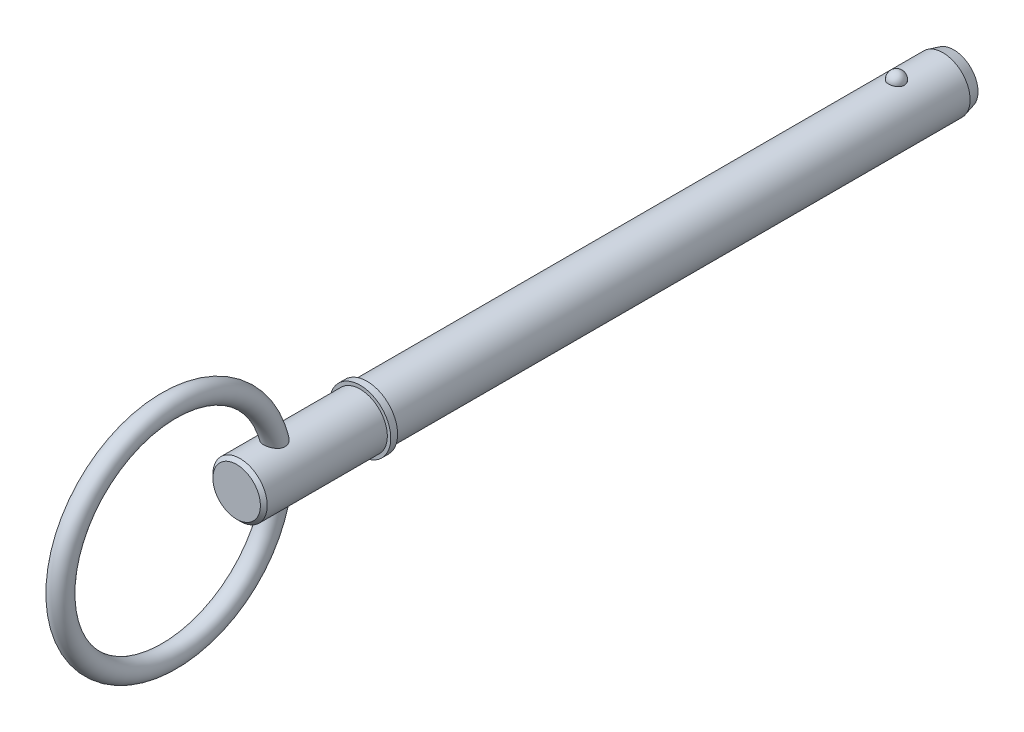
ISO-10303-21;
HEADER;
FILE_DESCRIPTION(('STEP AP214'),'2;1');
FILE_NAME('part.step','',(''),(''),'','','');
FILE_SCHEMA(('AUTOMOTIVE_DESIGN { 1 0 10303 214 1 1 1 1 }'));
ENDSEC;
DATA;
#1=APPLICATION_CONTEXT('core data for automotive mechanical design processes');
#2=APPLICATION_PROTOCOL_DEFINITION('international standard','automotive_design',2000,#1);
#3=PRODUCT_CONTEXT('',#1,'mechanical');
#4=PRODUCT('Part','Part','',(#3));
#5=PRODUCT_RELATED_PRODUCT_CATEGORY('part','',(#4));
#6=PRODUCT_DEFINITION_FORMATION('','',#4);
#7=PRODUCT_DEFINITION_CONTEXT('part definition',#1,'design');
#8=PRODUCT_DEFINITION('design','',#6,#7);
#9=PRODUCT_DEFINITION_SHAPE('','',#8);
#10=(LENGTH_UNIT() NAMED_UNIT(*) SI_UNIT(.MILLI.,.METRE.));
#11=(NAMED_UNIT(*) PLANE_ANGLE_UNIT() SI_UNIT($,.RADIAN.));
#12=(NAMED_UNIT(*) SI_UNIT($,.STERADIAN.) SOLID_ANGLE_UNIT());
#13=UNCERTAINTY_MEASURE_WITH_UNIT(LENGTH_MEASURE(1.E-05),#10,'distance_accuracy_value','');
#14=(GEOMETRIC_REPRESENTATION_CONTEXT(3) GLOBAL_UNCERTAINTY_ASSIGNED_CONTEXT((#13)) GLOBAL_UNIT_ASSIGNED_CONTEXT((#10,
#11,#12)) REPRESENTATION_CONTEXT('',''));
#15=CARTESIAN_POINT('',(0.,0.,0.));
#16=DIRECTION('',(0.,0.,1.));
#17=DIRECTION('',(1.,0.,0.));
#18=AXIS2_PLACEMENT_3D('',#15,#16,#17);
#19=CARTESIAN_POINT('',(0.,0.,76.2));
#20=DIRECTION('',(0.,0.,-1.));
#21=DIRECTION('',(-1.,0.,0.));
#22=AXIS2_PLACEMENT_3D('',#19,#20,#21);
#23=CYLINDRICAL_SURFACE('',#22,3.97);
#24=CARTESIAN_POINT('',(1.13787398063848,3.80343828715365,-1.15));
#25=CARTESIAN_POINT('',(1.13787307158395,3.80343910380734,-1.0857397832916));
#26=CARTESIAN_POINT('',(1.13264657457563,3.80501406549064,-1.02146820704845));
#27=CARTESIAN_POINT('',(1.11186534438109,3.81113760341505,-0.894749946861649));
#28=CARTESIAN_POINT('',(1.09630734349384,3.81568712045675,-0.832303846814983));
#29=CARTESIAN_POINT('',(1.05525533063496,3.82724281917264,-0.711040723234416));
#30=CARTESIAN_POINT('',(1.02976565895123,3.83424792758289,-0.65222212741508));
#31=CARTESIAN_POINT('',(0.969477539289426,3.84993235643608,-0.539814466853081));
#32=CARTESIAN_POINT('',(0.934679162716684,3.85861166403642,-0.48622536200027));
#33=CARTESIAN_POINT('',(0.856427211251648,3.87673176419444,-0.385470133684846));
#34=CARTESIAN_POINT('',(0.812928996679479,3.88617632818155,-0.338339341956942));
#35=CARTESIAN_POINT('',(0.718506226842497,3.90473543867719,-0.252134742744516));
#36=CARTESIAN_POINT('',(0.667581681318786,3.91384998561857,-0.213060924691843));
#37=CARTESIAN_POINT('',(0.559829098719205,3.93070626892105,-0.144169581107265));
#38=CARTESIAN_POINT('',(0.503019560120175,3.93845211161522,-0.114324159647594));
#39=CARTESIAN_POINT('',(0.384957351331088,3.95173781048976,-0.0645874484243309));
#40=CARTESIAN_POINT('',(0.323705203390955,3.95727792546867,-0.044694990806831));
#41=CARTESIAN_POINT('',(0.1997490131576,3.96544869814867,-0.015729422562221));
#42=CARTESIAN_POINT('',(0.137095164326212,3.96813298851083,-0.00645660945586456));
#43=CARTESIAN_POINT('',(0.0110617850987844,3.97048461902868,0.00167939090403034));
#44=CARTESIAN_POINT('',(-0.0523176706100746,3.97015226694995,0.000543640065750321));
#45=CARTESIAN_POINT('',(-0.176983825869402,3.96653606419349,-0.0120046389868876));
#46=CARTESIAN_POINT('',(-0.238287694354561,3.96329719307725,-0.0232605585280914));
#47=CARTESIAN_POINT('',(-0.358077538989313,3.95427494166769,-0.0555133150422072));
#48=CARTESIAN_POINT('',(-0.416563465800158,3.94849151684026,-0.0765103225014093));
#49=CARTESIAN_POINT('',(-0.529474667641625,3.9349475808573,-0.127824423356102));
#50=CARTESIAN_POINT('',(-0.583873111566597,3.92717527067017,-0.158197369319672));
#51=CARTESIAN_POINT('',(-0.686796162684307,3.9104901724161,-0.227402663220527));
#52=CARTESIAN_POINT('',(-0.735320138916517,3.90157726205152,-0.266235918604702));
#53=CARTESIAN_POINT('',(-0.826197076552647,3.88336108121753,-0.352210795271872));
#54=CARTESIAN_POINT('',(-0.868404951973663,3.87405356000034,-0.39950492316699));
#55=CARTESIAN_POINT('',(-0.944393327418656,3.85623507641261,-0.500572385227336));
#56=CARTESIAN_POINT('',(-0.978173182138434,3.84772417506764,-0.554346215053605));
#57=CARTESIAN_POINT('',(-1.036841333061,3.83233550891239,-0.667624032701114));
#58=CARTESIAN_POINT('',(-1.06161430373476,3.82547928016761,-0.727190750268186));
#59=CARTESIAN_POINT('',(-1.1010562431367,3.81431496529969,-0.849806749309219));
#60=CARTESIAN_POINT('',(-1.11572551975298,3.81000680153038,-0.912855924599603));
#61=CARTESIAN_POINT('',(-1.13455293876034,3.80444307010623,-1.0403529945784));
#62=CARTESIAN_POINT('',(-1.13875701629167,3.80317416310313,-1.10479351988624));
#63=CARTESIAN_POINT('',(-1.13668244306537,3.80379469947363,-1.23348881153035));
#64=CARTESIAN_POINT('',(-1.13040410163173,3.80568404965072,-1.29774358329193));
#65=CARTESIAN_POINT('',(-1.10758455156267,3.81238701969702,-1.42388263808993));
#66=CARTESIAN_POINT('',(-1.09109911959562,3.81718474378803,-1.48577787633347));
#67=CARTESIAN_POINT('',(-1.04831897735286,3.82915360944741,-1.6058363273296));
#68=CARTESIAN_POINT('',(-1.02202385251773,3.83632485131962,-1.66399938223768));
#69=CARTESIAN_POINT('',(-0.960087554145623,3.85229234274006,-1.77531672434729));
#70=CARTESIAN_POINT('',(-0.924393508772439,3.86109769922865,-1.82844028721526));
#71=CARTESIAN_POINT('',(-0.844617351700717,3.87932868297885,-1.92784641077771));
#72=CARTESIAN_POINT('',(-0.800534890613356,3.88875433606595,-1.97412868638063));
#73=CARTESIAN_POINT('',(-0.704909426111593,3.90722138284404,-2.05875748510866));
#74=CARTESIAN_POINT('',(-0.653336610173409,3.91626104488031,-2.09707073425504));
#75=CARTESIAN_POINT('',(-0.544251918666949,3.93290335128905,-2.16444159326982));
#76=CARTESIAN_POINT('',(-0.486740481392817,3.94050610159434,-2.19349988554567));
#77=CARTESIAN_POINT('',(-0.368186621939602,3.95333328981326,-2.24120607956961));
#78=CARTESIAN_POINT('',(-0.307200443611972,3.9585876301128,-2.25998559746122));
#79=CARTESIAN_POINT('',(-0.182787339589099,3.96627905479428,-2.28716436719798));
#80=CARTESIAN_POINT('',(-0.119360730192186,3.96871650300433,-2.29556495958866));
#81=CARTESIAN_POINT('',(0.0067634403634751,3.97048518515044,-2.30167748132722));
#82=CARTESIAN_POINT('',(0.0694499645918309,3.96987797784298,-2.299601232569));
#83=CARTESIAN_POINT('',(0.19355548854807,3.96576491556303,-2.28530777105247));
#84=CARTESIAN_POINT('',(0.254974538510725,3.96225917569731,-2.27309096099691));
#85=CARTESIAN_POINT('',(0.374550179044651,3.95274547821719,-2.2389384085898));
#86=CARTESIAN_POINT('',(0.43271967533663,3.94674835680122,-2.2170447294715));
#87=CARTESIAN_POINT('',(0.544514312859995,3.93288448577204,-2.16414952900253));
#88=CARTESIAN_POINT('',(0.598139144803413,3.92501760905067,-2.13314738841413));
#89=CARTESIAN_POINT('',(0.700284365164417,3.90809781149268,-2.06228741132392));
#90=CARTESIAN_POINT('',(0.748708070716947,3.89902775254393,-2.02229434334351));
#91=CARTESIAN_POINT('',(0.838215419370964,3.88077133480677,-1.93481443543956));
#92=CARTESIAN_POINT('',(0.87929781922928,3.87158495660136,-1.88732632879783));
#93=CARTESIAN_POINT('',(0.953804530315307,3.85391414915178,-1.78516284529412));
#94=CARTESIAN_POINT('',(0.98707138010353,3.8454460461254,-1.73036973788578));
#95=CARTESIAN_POINT('',(1.04410491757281,3.83035507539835,-1.61582422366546));
#96=CARTESIAN_POINT('',(1.06787445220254,3.82373165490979,-1.5560733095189));
#97=CARTESIAN_POINT('',(1.10358064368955,3.813570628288,-1.43904746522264));
#98=CARTESIAN_POINT('',(1.11641754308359,3.80980198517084,-1.38206535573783));
#99=CARTESIAN_POINT('',(1.13356451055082,3.80473547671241,-1.26672526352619));
#100=CARTESIAN_POINT('',(1.13787480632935,3.80343754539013,-1.20836731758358));
#101=CARTESIAN_POINT('',(1.13787398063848,3.80343828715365,-1.15));
#102=B_SPLINE_CURVE_WITH_KNOTS('',3,(#24,#25,#26,#27,#28,#29,#30,#31,#32,#33,#34,#35,#36,#37,
#38,#39,#40,#41,#42,#43,#44,#45,#46,#47,#48,#49,#50,#51,#52,#53,#54,#55,#56,#57,#58,#59,#60,#61,
#62,#63,#64,#65,#66,#67,#68,#69,#70,#71,#72,#73,#74,#75,#76,#77,#78,#79,#80,#81,#82,#83,#84,#85,
#86,#87,#88,#89,#90,#91,#92,#93,#94,#95,#96,#97,#98,#99,#100,#101),.UNSPECIFIED.,.T.,.F.,(4,2,2,
2,2,2,2,2,2,2,2,2,2,2,2,2,2,2,2,2,2,2,2,2,2,2,2,2,2,2,2,2,2,2,2,2,2,2,4),(0.,0.192571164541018,
0.385203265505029,0.577751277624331,0.770297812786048,0.963858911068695,1.15741975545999,
1.35038964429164,1.54333688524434,1.73259288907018,1.92182958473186,2.10818732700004,
2.2945483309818,2.48204164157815,2.66955507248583,2.86087083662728,3.05220124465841,
3.24590171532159,3.43959628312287,3.63243915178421,3.82527632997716,4.01706893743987,
4.20886965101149,4.40177324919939,4.59468488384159,4.78838651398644,4.9820738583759,
5.17321934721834,5.36434014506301,5.55161251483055,5.7388774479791,5.92533626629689,
6.11180776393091,6.30129785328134,6.49082000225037,6.68388392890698,6.87688993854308,
7.05180628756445,7.22671796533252),.UNSPECIFIED.);
#103=CARTESIAN_POINT('',(1.13787398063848,3.80343828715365,-1.15));
#104=VERTEX_POINT('',#103);
#105=EDGE_CURVE('E102',#104,#104,#102,.T.);
#106=ORIENTED_EDGE('',*,*,#105,.T.);
#107=EDGE_LOOP('',(#106));
#108=FACE_BOUND('',#107,.T.);
#109=CARTESIAN_POINT('',(0.,0.,-7.94400000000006));
#110=DIRECTION('',(0.,0.,-1.));
#111=DIRECTION('',(-1.,0.,0.));
#112=AXIS2_PLACEMENT_3D('',#109,#110,#111);
#113=CIRCLE('',#112,3.97);
#114=CARTESIAN_POINT('',(-3.97,0.,-7.94400000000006));
#115=VERTEX_POINT('',#114);
#116=EDGE_CURVE('E110',#115,#115,#113,.F.);
#117=ORIENTED_EDGE('',*,*,#116,.T.);
#118=EDGE_LOOP('',(#117));
#119=FACE_BOUND('',#118,.T.);
#120=CARTESIAN_POINT('',(0.,0.,76.2));
#121=DIRECTION('',(0.,0.,1.));
#122=DIRECTION('',(1.,0.,0.));
#123=AXIS2_PLACEMENT_3D('',#120,#121,#122);
#124=CIRCLE('',#123,3.97);
#125=CARTESIAN_POINT('',(3.97,0.,76.2));
#126=VERTEX_POINT('',#125);
#127=EDGE_CURVE('E108',#126,#126,#124,.T.);
#128=ORIENTED_EDGE('',*,*,#127,.F.);
#129=EDGE_LOOP('',(#128));
#130=FACE_BOUND('',#129,.T.);
#131=ADVANCED_FACE('F39',(#108,#119,#130),#23,.T.);
#132=CARTESIAN_POINT('',(0.,0.,-9.53));
#133=DIRECTION('',(0.,0.,-1.));
#134=DIRECTION('',(-1.,0.,0.));
#135=AXIS2_PLACEMENT_3D('',#132,#133,#134);
#136=PLANE('',#135);
#137=CARTESIAN_POINT('',(0.,0.,-9.53));
#138=DIRECTION('',(0.,0.,-1.));
#139=DIRECTION('',(-1.,0.,0.));
#140=AXIS2_PLACEMENT_3D('',#137,#138,#139);
#141=CIRCLE('',#140,3.54503258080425);
#142=CARTESIAN_POINT('',(-3.54503258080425,0.,-9.53));
#143=VERTEX_POINT('',#142);
#144=EDGE_CURVE('E142',#143,#143,#141,.T.);
#145=ORIENTED_EDGE('',*,*,#144,.T.);
#146=EDGE_LOOP('',(#145));
#147=FACE_BOUND('',#146,.T.);
#148=ADVANCED_FACE('F88',(#147),#136,.T.);
#149=CARTESIAN_POINT('',(0.,0.,-9.53));
#150=DIRECTION('',(0.,0.,1.));
#151=DIRECTION('',(1.,0.,0.));
#152=AXIS2_PLACEMENT_3D('',#149,#150,#151);
#153=CONICAL_SURFACE('',#152,3.54503258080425,0.261799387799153);
#154=ORIENTED_EDGE('',*,*,#116,.F.);
#155=EDGE_LOOP('',(#154));
#156=FACE_BOUND('',#155,.T.);
#157=ORIENTED_EDGE('',*,*,#144,.F.);
#158=EDGE_LOOP('',(#157));
#159=FACE_BOUND('',#158,.T.);
#160=ADVANCED_FACE('F94',(#156,#159),#153,.T.);
#161=CARTESIAN_POINT('',(0.,3.97,-1.15));
#162=DIRECTION('',(0.,1.,0.));
#163=DIRECTION('',(0.,0.,-1.));
#164=AXIS2_PLACEMENT_3D('',#161,#162,#163);
#165=SPHERICAL_SURFACE('',#164,1.15);
#166=ORIENTED_EDGE('',*,*,#105,.F.);
#167=EDGE_LOOP('',(#166));
#168=FACE_BOUND('',#167,.T.);
#169=ADVANCED_FACE('F113',(#168),#165,.T.);
#170=CARTESIAN_POINT('',(0.,0.,76.2));
#171=DIRECTION('',(0.,0.,-1.));
#172=DIRECTION('',(-1.,0.,0.));
#173=AXIS2_PLACEMENT_3D('',#170,#171,#172);
#174=PLANE('',#173);
#175=ORIENTED_EDGE('',*,*,#127,.T.);
#176=EDGE_LOOP('',(#175));
#177=FACE_BOUND('',#176,.T.);
#178=CARTESIAN_POINT('',(0.,0.,76.2));
#179=DIRECTION('',(0.,0.,-1.));
#180=DIRECTION('',(-1.,0.,0.));
#181=AXIS2_PLACEMENT_3D('',#178,#179,#180);
#182=CIRCLE('',#181,4.47);
#183=CARTESIAN_POINT('',(-4.47,0.,76.2));
#184=VERTEX_POINT('',#183);
#185=EDGE_CURVE('E109',#184,#184,#182,.T.);
#186=ORIENTED_EDGE('',*,*,#185,.T.);
#187=EDGE_LOOP('',(#186));
#188=FACE_BOUND('',#187,.T.);
#189=ADVANCED_FACE('F117',(#177,#188),#174,.T.);
#190=CARTESIAN_POINT('',(0.,0.,33.7287874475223));
#191=DIRECTION('',(0.,0.,-1.));
#192=DIRECTION('',(-1.,0.,0.));
#193=AXIS2_PLACEMENT_3D('',#190,#191,#192);
#194=CYLINDRICAL_SURFACE('',#193,4.47);
#195=CARTESIAN_POINT('',(0.,0.,77.2));
#196=DIRECTION('',(0.,0.,-1.));
#197=DIRECTION('',(-1.,0.,0.));
#198=AXIS2_PLACEMENT_3D('',#195,#196,#197);
#199=CIRCLE('',#198,4.47);
#200=CARTESIAN_POINT('',(-4.47,0.,77.2));
#201=VERTEX_POINT('',#200);
#202=EDGE_CURVE('E134',#201,#201,#199,.T.);
#203=ORIENTED_EDGE('',*,*,#202,.T.);
#204=EDGE_LOOP('',(#203));
#205=FACE_BOUND('',#204,.T.);
#206=ORIENTED_EDGE('',*,*,#185,.F.);
#207=EDGE_LOOP('',(#206));
#208=FACE_BOUND('',#207,.T.);
#209=ADVANCED_FACE('F121',(#205,#208),#194,.T.);
#210=CARTESIAN_POINT('',(0.,4.47,77.2));
#211=DIRECTION('',(0.,0.,1.));
#212=DIRECTION('',(1.,0.,0.));
#213=AXIS2_PLACEMENT_3D('',#210,#211,#212);
#214=PLANE('',#213);
#215=CARTESIAN_POINT('',(0.,0.,77.2));
#216=DIRECTION('',(0.,0.,1.));
#217=DIRECTION('',(1.,0.,0.));
#218=AXIS2_PLACEMENT_3D('',#215,#216,#217);
#219=CIRCLE('',#218,3.97);
#220=CARTESIAN_POINT('',(3.97,0.,77.2));
#221=VERTEX_POINT('',#220);
#222=EDGE_CURVE('E112',#221,#221,#219,.T.);
#223=ORIENTED_EDGE('',*,*,#222,.F.);
#224=EDGE_LOOP('',(#223));
#225=FACE_BOUND('',#224,.T.);
#226=ORIENTED_EDGE('',*,*,#202,.F.);
#227=EDGE_LOOP('',(#226));
#228=FACE_BOUND('',#227,.T.);
#229=ADVANCED_FACE('F85',(#225,#228),#214,.T.);
#230=CARTESIAN_POINT('',(0.,0.,95.25));
#231=DIRECTION('',(0.,0.,-1.));
#232=DIRECTION('',(-1.,0.,0.));
#233=AXIS2_PLACEMENT_3D('',#230,#231,#232);
#234=CYLINDRICAL_SURFACE('',#233,3.97);
#235=CARTESIAN_POINT('',(-0.740636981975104,-3.90030215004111,88.3942081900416));
#236=CARTESIAN_POINT('',(-0.667733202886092,-3.91414543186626,88.354930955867));
#237=CARTESIAN_POINT('',(-0.591347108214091,-3.92651643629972,88.3215983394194));
#238=CARTESIAN_POINT('',(-0.43370932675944,-3.94703799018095,88.2675410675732));
#239=CARTESIAN_POINT('',(-0.352458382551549,-3.95518918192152,88.2468144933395));
#240=CARTESIAN_POINT('',(-0.187320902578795,-3.96644185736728,88.2184263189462));
#241=CARTESIAN_POINT('',(-0.103433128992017,-3.9695409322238,88.2107709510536));
#242=CARTESIAN_POINT('',(0.064529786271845,-3.97036376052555,88.2087268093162));
#243=CARTESIAN_POINT('',(0.148604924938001,-3.96808759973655,88.2143378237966));
#244=CARTESIAN_POINT('',(0.313967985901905,-3.95842655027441,88.2386101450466));
#245=CARTESIAN_POINT('',(0.395270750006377,-3.95107581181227,88.2571842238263));
#246=CARTESIAN_POINT('',(0.553418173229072,-3.93204472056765,88.3068699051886));
#247=CARTESIAN_POINT('',(0.630262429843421,-3.92036397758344,88.3379826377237));
#248=CARTESIAN_POINT('',(0.777983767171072,-3.89375421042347,88.4123739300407));
#249=CARTESIAN_POINT('',(0.848809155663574,-3.8788003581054,88.4557462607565));
#250=CARTESIAN_POINT('',(0.981880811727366,-3.84727071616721,88.5536515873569));
#251=CARTESIAN_POINT('',(1.04412630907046,-3.83069478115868,88.6081855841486));
#252=CARTESIAN_POINT('',(1.15846819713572,-3.79768496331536,88.7274397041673));
#253=CARTESIAN_POINT('',(1.21053047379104,-3.78125172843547,88.7921927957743));
#254=CARTESIAN_POINT('',(1.30266807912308,-3.75050988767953,88.9301698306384));
#255=CARTESIAN_POINT('',(1.34274789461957,-3.73620048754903,89.0033905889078));
#256=CARTESIAN_POINT('',(1.40857853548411,-3.71187334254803,89.1536278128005));
#257=CARTESIAN_POINT('',(1.43477198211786,-3.70172571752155,89.2304292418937));
#258=CARTESIAN_POINT('',(1.47426417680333,-3.68617713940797,89.3877211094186));
#259=CARTESIAN_POINT('',(1.48756557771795,-3.68077520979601,89.468210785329));
#260=CARTESIAN_POINT('',(1.5011302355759,-3.67526295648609,89.6282774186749));
#261=CARTESIAN_POINT('',(1.50172918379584,-3.67501639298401,89.7078221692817));
#262=CARTESIAN_POINT('',(1.4912869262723,-3.67926498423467,89.8660010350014));
#263=CARTESIAN_POINT('',(1.48024221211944,-3.68376156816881,89.9446348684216));
#264=CARTESIAN_POINT('',(1.44631002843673,-3.69722026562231,90.1039961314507));
#265=CARTESIAN_POINT('',(1.42273446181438,-3.7064405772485,90.1845537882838));
#266=CARTESIAN_POINT('',(1.36440745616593,-3.72830487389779,90.3410229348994));
#267=CARTESIAN_POINT('',(1.32965006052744,-3.74095068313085,90.4169319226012));
#268=CARTESIAN_POINT('',(1.244983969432,-3.77003365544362,90.5715893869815));
#269=CARTESIAN_POINT('',(1.19374759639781,-3.78674477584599,90.6495625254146));
#270=CARTESIAN_POINT('',(1.07927226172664,-3.82094743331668,90.796060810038));
#271=CARTESIAN_POINT('',(1.0160234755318,-3.83843960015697,90.8645781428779));
#272=CARTESIAN_POINT('',(0.875824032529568,-3.87288453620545,90.9922425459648));
#273=CARTESIAN_POINT('',(0.798445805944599,-3.88979192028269,91.0509375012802));
#274=CARTESIAN_POINT('',(0.633271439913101,-3.92005992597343,91.1524486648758));
#275=CARTESIAN_POINT('',(0.545492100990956,-3.9334261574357,91.1952900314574));
#276=CARTESIAN_POINT('',(0.374503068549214,-3.9531041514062,91.2573026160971));
#277=CARTESIAN_POINT('',(0.292250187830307,-3.96011991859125,91.2788718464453));
#278=CARTESIAN_POINT('',(0.124887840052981,-3.96891507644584,91.3058171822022));
#279=CARTESIAN_POINT('',(0.0397822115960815,-3.97070123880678,91.311214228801));
#280=CARTESIAN_POINT('',(-0.116598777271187,-3.96893737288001,91.3058414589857));
#281=CARTESIAN_POINT('',(-0.187977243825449,-3.96616998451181,91.2974431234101));
#282=CARTESIAN_POINT('',(-0.32822445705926,-3.95703238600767,91.2693459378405));
#283=CARTESIAN_POINT('',(-0.397092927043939,-3.95066177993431,91.2496458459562));
#284=CARTESIAN_POINT('',(-0.53077782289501,-3.93493622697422,91.2000024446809));
#285=CARTESIAN_POINT('',(-0.595585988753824,-3.92557541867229,91.1700390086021));
#286=CARTESIAN_POINT('',(-0.719890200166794,-3.904694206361,91.1012213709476));
#287=CARTESIAN_POINT('',(-0.779384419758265,-3.89317306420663,91.0623641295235));
#288=CARTESIAN_POINT('',(-0.900171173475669,-3.86715924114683,90.9711356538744));
#289=CARTESIAN_POINT('',(-0.960570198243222,-3.85247602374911,90.9176378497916));
#290=CARTESIAN_POINT('',(-1.07286582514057,-3.82272677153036,90.8024377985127));
#291=CARTESIAN_POINT('',(-1.12475588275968,-3.8076604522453,90.7407293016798));
#292=CARTESIAN_POINT('',(-1.22682603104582,-3.7761197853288,90.6003072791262));
#293=CARTESIAN_POINT('',(-1.27547686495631,-3.75979238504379,90.5204426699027));
#294=CARTESIAN_POINT('',(-1.35956460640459,-3.73021138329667,90.3534537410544));
#295=CARTESIAN_POINT('',(-1.39499536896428,-3.71695921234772,90.2663260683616));
#296=CARTESIAN_POINT('',(-1.45224550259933,-3.6949785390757,90.0837644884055));
#297=CARTESIAN_POINT('',(-1.47355906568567,-3.68641985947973,89.9881485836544));
#298=CARTESIAN_POINT('',(-1.49891316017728,-3.67618897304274,89.7943060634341));
#299=CARTESIAN_POINT('',(-1.50297414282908,-3.67450861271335,89.6960826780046));
#300=CARTESIAN_POINT('',(-1.49322338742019,-3.67847743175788,89.5115204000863));
#301=CARTESIAN_POINT('',(-1.48132891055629,-3.68334053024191,89.425062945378));
#302=CARTESIAN_POINT('',(-1.44277978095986,-3.69860964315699,89.2560202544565));
#303=CARTESIAN_POINT('',(-1.41613105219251,-3.70901343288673,89.1734334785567));
#304=CARTESIAN_POINT('',(-1.35164005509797,-3.73296583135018,89.0217432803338));
#305=CARTESIAN_POINT('',(-1.31494998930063,-3.7461693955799,88.9520907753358));
#306=CARTESIAN_POINT('',(-1.23078033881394,-3.77465882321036,88.8201142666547));
#307=CARTESIAN_POINT('',(-1.18329862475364,-3.7899450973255,88.7577917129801));
#308=CARTESIAN_POINT('',(-1.07555346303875,-3.82196646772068,88.638244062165));
#309=CARTESIAN_POINT('',(-1.01467770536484,-3.83873247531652,88.5815789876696));
#310=CARTESIAN_POINT('',(-0.883925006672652,-3.87093079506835,88.479334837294));
#311=CARTESIAN_POINT('',(-0.814046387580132,-3.88636285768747,88.4337578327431));
#312=CARTESIAN_POINT('',(-0.740636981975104,-3.90030215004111,88.3942081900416));
#313=B_SPLINE_CURVE_WITH_KNOTS('',3,(#235,#236,#237,#238,#239,#240,#241,#242,#243,#244,#245,
#246,#247,#248,#249,#250,#251,#252,#253,#254,#255,#256,#257,#258,#259,#260,#261,#262,#263,#264,
#265,#266,#267,#268,#269,#270,#271,#272,#273,#274,#275,#276,#277,#278,#279,#280,#281,#282,#283,
#284,#285,#286,#287,#288,#289,#290,#291,#292,#293,#294,#295,#296,#297,#298,#299,#300,#301,#302,
#303,#304,#305,#306,#307,#308,#309,#310,#311,#312),.UNSPECIFIED.,.T.,.F.,(4,2,2,2,2,2,2,2,2,2,2,
2,2,2,2,2,2,2,2,2,2,2,2,2,2,2,2,2,2,2,2,2,2,2,2,2,2,2,4),(0.,0.251585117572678,
0.503131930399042,0.754798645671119,1.00646134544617,1.25644674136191,1.50645467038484,
1.75842915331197,2.01042624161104,2.26325358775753,2.51598614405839,2.76008726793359,
3.00413815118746,3.24173115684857,3.47939577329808,3.7317117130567,3.9841622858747,
4.26728153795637,4.55063334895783,4.84469622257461,5.13829042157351,5.39265192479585,
5.64668391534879,5.86142364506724,6.07618697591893,6.29137389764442,6.50663447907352,
6.75172833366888,6.99700982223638,7.28055118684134,7.56422418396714,7.85757857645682,
8.15058512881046,8.41135406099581,8.67201836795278,8.91039015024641,9.14880900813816,
9.40209172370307,9.65542171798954),.UNSPECIFIED.);
#314=CARTESIAN_POINT('',(-0.740636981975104,-3.90030215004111,88.3942081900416));
#315=VERTEX_POINT('',#314);
#316=EDGE_CURVE('E10',#315,#315,#313,.T.);
#317=ORIENTED_EDGE('',*,*,#316,.F.);
#318=EDGE_LOOP('',(#317));
#319=FACE_BOUND('',#318,.T.);
#320=CARTESIAN_POINT('',(-0.740636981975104,3.90030215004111,88.3942081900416));
#321=CARTESIAN_POINT('',(-0.813118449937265,3.88653971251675,88.4332571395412));
#322=CARTESIAN_POINT('',(-0.882149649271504,3.8713229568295,88.4781781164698));
#323=CARTESIAN_POINT('',(-1.01146335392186,3.83956738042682,88.5788428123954));
#324=CARTESIAN_POINT('',(-1.07174704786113,3.82302873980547,88.6345850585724));
#325=CARTESIAN_POINT('',(-1.18196955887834,3.79040422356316,88.7557938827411));
#326=CARTESIAN_POINT('',(-1.23189269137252,3.77431906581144,88.821274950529));
#327=CARTESIAN_POINT('',(-1.31978443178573,3.74449359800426,88.9602948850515));
#328=CARTESIAN_POINT('',(-1.35775694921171,3.73075252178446,89.0338311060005));
#329=CARTESIAN_POINT('',(-1.41974909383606,3.7075981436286,89.1847128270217));
#330=CARTESIAN_POINT('',(-1.44413408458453,3.69807309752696,89.2618910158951));
#331=CARTESIAN_POINT('',(-1.4800654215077,3.6838411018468,89.419590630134));
#332=CARTESIAN_POINT('',(-1.49161368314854,3.67913343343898,89.5001115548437));
#333=CARTESIAN_POINT('',(-1.50187378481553,3.67495610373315,89.6602618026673));
#334=CARTESIAN_POINT('',(-1.50086613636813,3.67537197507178,89.7398709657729));
#335=CARTESIAN_POINT('',(-1.48728932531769,3.68088569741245,89.8979172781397));
#336=CARTESIAN_POINT('',(-1.47471654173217,3.68598501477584,89.9763540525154));
#337=CARTESIAN_POINT('',(-1.43761932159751,3.70061780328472,90.1355940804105));
#338=CARTESIAN_POINT('',(-1.41233843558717,3.71042990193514,90.2161940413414));
#339=CARTESIAN_POINT('',(-1.35057314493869,3.73335405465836,90.3724850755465));
#340=CARTESIAN_POINT('',(-1.31408239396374,3.74646797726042,90.4481733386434));
#341=CARTESIAN_POINT('',(-1.2257172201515,3.77636700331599,90.6020428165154));
#342=CARTESIAN_POINT('',(-1.17251505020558,3.79340436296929,90.6794161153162));
#343=CARTESIAN_POINT('',(-1.05406412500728,3.82800923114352,90.8243069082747));
#344=CARTESIAN_POINT('',(-0.988806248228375,3.84557713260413,90.8918168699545));
#345=CARTESIAN_POINT('',(-0.845287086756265,3.87968695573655,91.0162211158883));
#346=CARTESIAN_POINT('',(-0.766724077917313,3.89618874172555,91.0727822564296));
#347=CARTESIAN_POINT('',(-0.599538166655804,3.92537936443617,91.1696962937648));
#348=CARTESIAN_POINT('',(-0.510933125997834,3.93807482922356,91.2100774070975));
#349=CARTESIAN_POINT('',(-0.339677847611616,3.95624165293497,91.2670085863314));
#350=CARTESIAN_POINT('',(-0.257968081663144,3.96248273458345,91.2861280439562));
#351=CARTESIAN_POINT('',(-0.0922002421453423,3.96979198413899,91.3084736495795));
#352=CARTESIAN_POINT('',(-0.00814495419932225,3.97086604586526,91.3117179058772));
#353=CARTESIAN_POINT('',(0.146484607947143,3.96793776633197,91.3027977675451));
#354=CARTESIAN_POINT('',(0.217212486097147,3.96466338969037,91.2928433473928));
#355=CARTESIAN_POINT('',(0.355938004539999,3.95462310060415,91.2618888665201));
#356=CARTESIAN_POINT('',(0.423935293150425,3.94785673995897,91.240887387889));
#357=CARTESIAN_POINT('',(0.556534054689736,3.93137424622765,91.1886148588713));
#358=CARTESIAN_POINT('',(0.621075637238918,3.92161865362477,91.1572059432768));
#359=CARTESIAN_POINT('',(0.744663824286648,3.90004074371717,91.0855756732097));
#360=CARTESIAN_POINT('',(0.803708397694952,3.88821766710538,91.0453510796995));
#361=CARTESIAN_POINT('',(0.923664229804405,3.86161149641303,90.9510569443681));
#362=CARTESIAN_POINT('',(0.983622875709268,3.84664723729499,90.8958282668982));
#363=CARTESIAN_POINT('',(1.09477654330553,3.816501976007,90.7771942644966));
#364=CARTESIAN_POINT('',(1.14596459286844,3.80132081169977,90.7137825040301));
#365=CARTESIAN_POINT('',(1.24603510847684,3.76980809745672,90.5699890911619));
#366=CARTESIAN_POINT('',(1.29338223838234,3.753652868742,90.4884933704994));
#367=CARTESIAN_POINT('',(1.37450267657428,3.72471527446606,90.3183960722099));
#368=CARTESIAN_POINT('',(1.40827109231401,3.71193412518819,90.2297919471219));
#369=CARTESIAN_POINT('',(1.46140533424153,3.6913461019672,90.0455436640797));
#370=CARTESIAN_POINT('',(1.48042991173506,3.6836576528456,89.9497859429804));
#371=CARTESIAN_POINT('',(1.50115029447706,3.67526750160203,89.7561286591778));
#372=CARTESIAN_POINT('',(1.50286713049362,3.67455732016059,89.6582318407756));
#373=CARTESIAN_POINT('',(1.48878143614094,3.68028077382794,89.4752085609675));
#374=CARTESIAN_POINT('',(1.47496153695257,3.68590609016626,89.3899028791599));
#375=CARTESIAN_POINT('',(1.43287242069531,3.70247002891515,89.2234763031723));
#376=CARTESIAN_POINT('',(1.40460762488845,3.7134070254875,89.1423541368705));
#377=CARTESIAN_POINT('',(1.33714680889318,3.7381964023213,88.9931046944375));
#378=CARTESIAN_POINT('',(1.29898330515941,3.7517524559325,88.9244572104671));
#379=CARTESIAN_POINT('',(1.21206000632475,3.78072797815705,88.7946829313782));
#380=CARTESIAN_POINT('',(1.16329942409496,3.79614758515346,88.7335566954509));
#381=CARTESIAN_POINT('',(1.05526740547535,3.82760231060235,88.6188656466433));
#382=CARTESIAN_POINT('',(0.995782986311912,3.84364346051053,88.5655033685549));
#383=CARTESIAN_POINT('',(0.868651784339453,3.8743538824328,88.4690998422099));
#384=CARTESIAN_POINT('',(0.80100358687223,3.88902291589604,88.4260603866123));
#385=CARTESIAN_POINT('',(0.656696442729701,3.91602140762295,88.3497891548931));
#386=CARTESIAN_POINT('',(0.579799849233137,3.92824686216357,88.3169691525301));
#387=CARTESIAN_POINT('',(0.421219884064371,3.94839960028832,88.2640374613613));
#388=CARTESIAN_POINT('',(0.339536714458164,3.95632706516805,88.2439252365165));
#389=CARTESIAN_POINT('',(0.173681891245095,3.96706909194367,88.2168661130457));
#390=CARTESIAN_POINT('',(0.0895101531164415,3.96988347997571,88.2099196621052));
#391=CARTESIAN_POINT('',(-0.0788915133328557,3.97010941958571,88.2093589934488));
#392=CARTESIAN_POINT('',(-0.163121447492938,3.96752031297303,88.2157463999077));
#393=CARTESIAN_POINT('',(-0.332911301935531,3.9569711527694,88.2422872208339));
#394=CARTESIAN_POINT('',(-0.41836320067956,3.9487768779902,88.2630414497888));
#395=CARTESIAN_POINT('',(-0.584033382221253,3.92769448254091,88.3184250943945));
#396=CARTESIAN_POINT('',(-0.66425117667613,3.91480592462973,88.3530558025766));
#397=CARTESIAN_POINT('',(-0.740636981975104,3.90030215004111,88.3942081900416));
#398=B_SPLINE_CURVE_WITH_KNOTS('',3,(#320,#321,#322,#323,#324,#325,#326,#327,#328,#329,#330,
#331,#332,#333,#334,#335,#336,#337,#338,#339,#340,#341,#342,#343,#344,#345,#346,#347,#348,#349,
#350,#351,#352,#353,#354,#355,#356,#357,#358,#359,#360,#361,#362,#363,#364,#365,#366,#367,#368,
#369,#370,#371,#372,#373,#374,#375,#376,#377,#378,#379,#380,#381,#382,#383,#384,#385,#386,#387,
#388,#389,#390,#391,#392,#393,#394,#395,#396,#397),.UNSPECIFIED.,.T.,.F.,(4,2,2,2,2,2,2,2,2,2,2,
2,2,2,2,2,2,2,2,2,2,2,2,2,2,2,2,2,2,2,2,2,2,2,2,2,2,2,4),(0.,0.250115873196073,0.50019772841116,
0.750655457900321,1.00103116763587,1.24430196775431,1.48753646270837,1.72534678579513,
1.96323159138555,2.2173360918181,2.47158471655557,2.75662009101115,3.0418720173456,
3.33477180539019,3.62715855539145,3.87803518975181,4.12862559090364,4.34211896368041,
4.55563974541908,4.7721103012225,4.98866052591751,5.23635199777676,5.48423946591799,
5.76983687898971,6.05553710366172,6.34766729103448,6.63944246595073,6.89782349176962,
7.15612548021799,7.39414671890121,7.63218564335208,7.87561406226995,8.11908472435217,
8.37137533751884,8.62365530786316,8.87594385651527,9.12826313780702,9.39182737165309,
9.65541616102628),.UNSPECIFIED.);
#399=CARTESIAN_POINT('',(-0.740636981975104,3.90030215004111,88.3942081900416));
#400=VERTEX_POINT('',#399);
#401=EDGE_CURVE('E51',#400,#400,#398,.T.);
#402=ORIENTED_EDGE('',*,*,#401,.F.);
#403=EDGE_LOOP('',(#402));
#404=FACE_BOUND('',#403,.T.);
#405=CARTESIAN_POINT('',(0.,0.,94.7499999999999));
#406=DIRECTION('',(0.,0.,-1.));
#407=DIRECTION('',(-1.,0.,0.));
#408=AXIS2_PLACEMENT_3D('',#405,#406,#407);
#409=CIRCLE('',#408,3.97);
#410=CARTESIAN_POINT('',(-3.97,0.,94.7499999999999));
#411=VERTEX_POINT('',#410);
#412=EDGE_CURVE('E64',#411,#411,#409,.T.);
#413=ORIENTED_EDGE('',*,*,#412,.T.);
#414=EDGE_LOOP('',(#413));
#415=FACE_BOUND('',#414,.T.);
#416=ORIENTED_EDGE('',*,*,#222,.T.);
#417=EDGE_LOOP('',(#416));
#418=FACE_BOUND('',#417,.T.);
#419=ADVANCED_FACE('F69',(#319,#404,#415,#418),#234,.T.);
#420=CARTESIAN_POINT('',(0.,0.,95.25));
#421=DIRECTION('',(0.,0.,-1.));
#422=DIRECTION('',(-1.,0.,0.));
#423=AXIS2_PLACEMENT_3D('',#420,#421,#422);
#424=PLANE('',#423);
#425=CARTESIAN_POINT('',(0.,0.,95.25));
#426=DIRECTION('',(0.,0.,-1.));
#427=DIRECTION('',(-1.,0.,0.));
#428=AXIS2_PLACEMENT_3D('',#425,#426,#427);
#429=CIRCLE('',#428,3.46999999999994);
#430=CARTESIAN_POINT('',(-3.46999999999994,0.,95.25));
#431=VERTEX_POINT('',#430);
#432=EDGE_CURVE('E58',#431,#431,#429,.F.);
#433=ORIENTED_EDGE('',*,*,#432,.T.);
#434=EDGE_LOOP('',(#433));
#435=FACE_BOUND('',#434,.T.);
#436=ADVANCED_FACE('F76',(#435),#424,.F.);
#437=CARTESIAN_POINT('',(0.,0.,94.7499999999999));
#438=DIRECTION('',(0.,0.,-1.));
#439=DIRECTION('',(-1.,0.,0.));
#440=AXIS2_PLACEMENT_3D('',#437,#438,#439);
#441=CONICAL_SURFACE('',#440,3.97,0.785398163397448);
#442=ORIENTED_EDGE('',*,*,#432,.F.);
#443=EDGE_LOOP('',(#442));
#444=FACE_BOUND('',#443,.T.);
#445=ORIENTED_EDGE('',*,*,#412,.F.);
#446=EDGE_LOOP('',(#445));
#447=FACE_BOUND('',#446,.T.);
#448=ADVANCED_FACE('F41',(#444,#447),#441,.T.);
#449=CARTESIAN_POINT('',(0.,0.,105.125));
#450=DIRECTION('',(1.,0.,0.));
#451=DIRECTION('',(0.,0.,-1.));
#452=AXIS2_PLACEMENT_3D('',#449,#450,#451);
#453=TOROIDAL_SURFACE('',#452,15.875,1.5);
#454=ORIENTED_EDGE('',*,*,#316,.T.);
#455=EDGE_LOOP('',(#454));
#456=FACE_BOUND('',#455,.T.);
#457=ORIENTED_EDGE('',*,*,#401,.T.);
#458=EDGE_LOOP('',(#457));
#459=FACE_BOUND('',#458,.T.);
#460=ADVANCED_FACE('F73',(#456,#459),#453,.T.);
#461=CLOSED_SHELL('',(#131,#148,#160,#169,#189,#209,#229,#419,#436,#448,#460));
#462=MANIFOLD_SOLID_BREP('B2',#461);
#463=ADVANCED_BREP_SHAPE_REPRESENTATION('',(#18,#462),#14);
#464=SHAPE_DEFINITION_REPRESENTATION(#9,#463);
ENDSEC;
END-ISO-10303-21;
